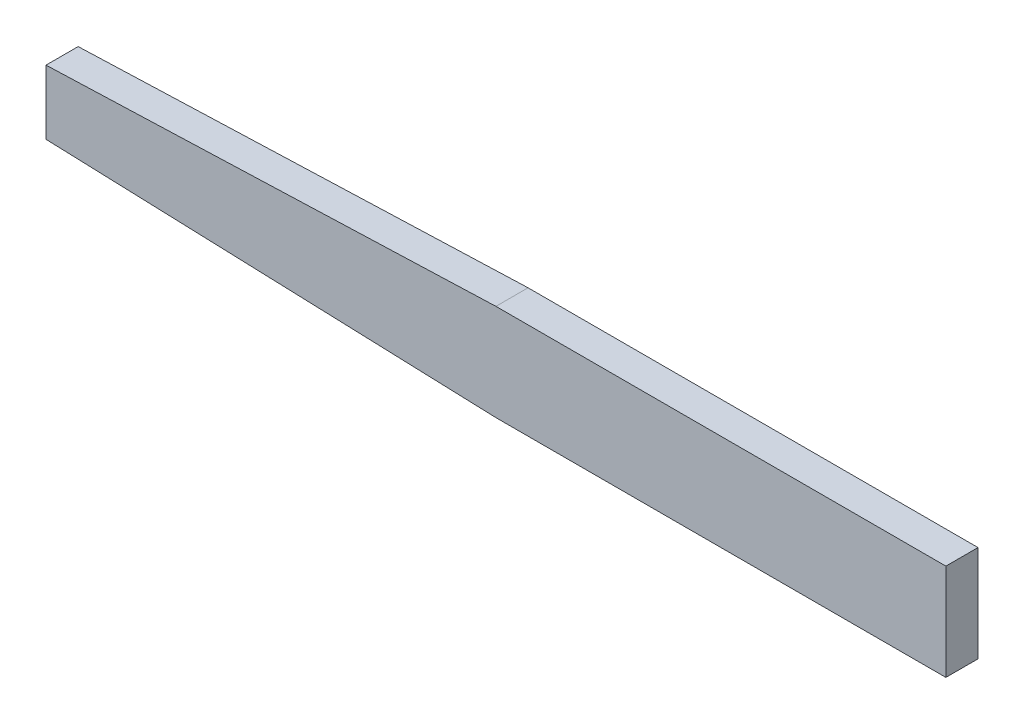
ISO-10303-21;
HEADER;
FILE_DESCRIPTION(('STEP AP214'),'2;1');
FILE_NAME('part.step','',(''),(''),'','','');
FILE_SCHEMA(('AUTOMOTIVE_DESIGN { 1 0 10303 214 1 1 1 1 }'));
ENDSEC;
DATA;
#1=APPLICATION_CONTEXT('core data for automotive mechanical design processes');
#2=APPLICATION_PROTOCOL_DEFINITION('international standard','automotive_design',2000,#1);
#3=PRODUCT_CONTEXT('',#1,'mechanical');
#4=PRODUCT('Part','Part','',(#3));
#5=PRODUCT_RELATED_PRODUCT_CATEGORY('part','',(#4));
#6=PRODUCT_DEFINITION_FORMATION('','',#4);
#7=PRODUCT_DEFINITION_CONTEXT('part definition',#1,'design');
#8=PRODUCT_DEFINITION('design','',#6,#7);
#9=PRODUCT_DEFINITION_SHAPE('','',#8);
#10=(LENGTH_UNIT() NAMED_UNIT(*) SI_UNIT(.MILLI.,.METRE.));
#11=(NAMED_UNIT(*) PLANE_ANGLE_UNIT() SI_UNIT($,.RADIAN.));
#12=(NAMED_UNIT(*) SI_UNIT($,.STERADIAN.) SOLID_ANGLE_UNIT());
#13=UNCERTAINTY_MEASURE_WITH_UNIT(LENGTH_MEASURE(1.E-05),#10,'distance_accuracy_value','');
#14=(GEOMETRIC_REPRESENTATION_CONTEXT(3) GLOBAL_UNCERTAINTY_ASSIGNED_CONTEXT((#13)) GLOBAL_UNIT_ASSIGNED_CONTEXT((#10,
#11,#12)) REPRESENTATION_CONTEXT('',''));
#15=CARTESIAN_POINT('',(0.,0.,0.));
#16=DIRECTION('',(0.,0.,1.));
#17=DIRECTION('',(1.,0.,0.));
#18=AXIS2_PLACEMENT_3D('',#15,#16,#17);
#19=CARTESIAN_POINT('',(-355.6,38.1,-6.35039294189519));
#20=DIRECTION('',(-1.,0.,0.));
#21=DIRECTION('',(0.,0.,1.));
#22=AXIS2_PLACEMENT_3D('',#19,#20,#21);
#23=PLANE('',#22);
#24=DIRECTION('',(0.,-1.,0.));
#25=VECTOR('',#24,1.);
#26=CARTESIAN_POINT('',(-355.6,38.1,0.));
#27=LINE('',#26,#25);
#28=CARTESIAN_POINT('',(-355.6,31.75,0.));
#29=VERTEX_POINT('',#28);
#30=CARTESIAN_POINT('',(-355.6,6.35,0.));
#31=VERTEX_POINT('',#30);
#32=EDGE_CURVE('E104',#29,#31,#27,.T.);
#33=ORIENTED_EDGE('',*,*,#32,.F.);
#34=DIRECTION('',(0.,0.,-1.));
#35=VECTOR('',#34,1.);
#36=CARTESIAN_POINT('',(-355.6,31.75,463.20083901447));
#37=LINE('',#36,#35);
#38=CARTESIAN_POINT('',(-355.6,31.75,-12.7));
#39=VERTEX_POINT('',#38);
#40=EDGE_CURVE('E50',#29,#39,#37,.T.);
#41=ORIENTED_EDGE('',*,*,#40,.T.);
#42=DIRECTION('',(0.,-1.,0.));
#43=VECTOR('',#42,1.);
#44=CARTESIAN_POINT('',(-355.6,38.1,-12.7));
#45=LINE('',#44,#43);
#46=CARTESIAN_POINT('',(-355.6,6.35,-12.7));
#47=VERTEX_POINT('',#46);
#48=EDGE_CURVE('E99',#39,#47,#45,.T.);
#49=ORIENTED_EDGE('',*,*,#48,.T.);
#50=DIRECTION('',(0.,0.,-1.));
#51=VECTOR('',#50,1.);
#52=CARTESIAN_POINT('',(-355.6,6.35,463.20083901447));
#53=LINE('',#52,#51);
#54=EDGE_CURVE('E124',#31,#47,#53,.T.);
#55=ORIENTED_EDGE('',*,*,#54,.F.);
#56=EDGE_LOOP('',(#33,#41,#49,#55));
#57=FACE_BOUND('',#56,.T.);
#58=ADVANCED_FACE('F35',(#57),#23,.T.);
#59=CARTESIAN_POINT('',(-454.733765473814,38.1,-12.7));
#60=DIRECTION('',(0.,0.,-1.));
#61=DIRECTION('',(-1.,0.,0.));
#62=AXIS2_PLACEMENT_3D('',#59,#60,#61);
#63=PLANE('',#62);
#64=DIRECTION('',(-0.99936285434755,-0.0356915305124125,0.));
#65=VECTOR('',#64,1.);
#66=CARTESIAN_POINT('',(-454.380983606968,28.2221077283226,-12.7));
#67=LINE('',#66,#65);
#68=CARTESIAN_POINT('',(-177.8,38.1,-12.7));
#69=VERTEX_POINT('',#68);
#70=EDGE_CURVE('E114',#69,#39,#67,.T.);
#71=ORIENTED_EDGE('',*,*,#70,.F.);
#72=DIRECTION('',(1.,0.,0.));
#73=VECTOR('',#72,1.);
#74=CARTESIAN_POINT('',(-454.733765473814,38.1,-12.7));
#75=LINE('',#74,#73);
#76=CARTESIAN_POINT('',(0.,38.1,-12.7));
#77=VERTEX_POINT('',#76);
#78=EDGE_CURVE('E112',#69,#77,#75,.T.);
#79=ORIENTED_EDGE('',*,*,#78,.T.);
#80=DIRECTION('',(0.,-1.,0.));
#81=VECTOR('',#80,1.);
#82=CARTESIAN_POINT('',(0.,38.1,-12.7));
#83=LINE('',#82,#81);
#84=CARTESIAN_POINT('',(0.,0.,-12.7));
#85=VERTEX_POINT('',#84);
#86=EDGE_CURVE('E118',#77,#85,#83,.T.);
#87=ORIENTED_EDGE('',*,*,#86,.T.);
#88=DIRECTION('',(1.,0.,0.));
#89=VECTOR('',#88,1.);
#90=CARTESIAN_POINT('',(-454.733765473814,0.,-12.7));
#91=LINE('',#90,#89);
#92=CARTESIAN_POINT('',(-177.8,0.,-12.7));
#93=VERTEX_POINT('',#92);
#94=EDGE_CURVE('E110',#93,#85,#91,.T.);
#95=ORIENTED_EDGE('',*,*,#94,.F.);
#96=DIRECTION('',(0.99936285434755,-0.0356915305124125,0.));
#97=VECTOR('',#96,1.);
#98=CARTESIAN_POINT('',(-455.739964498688,9.92642730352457,-12.7));
#99=LINE('',#98,#97);
#100=EDGE_CURVE('E95',#47,#93,#99,.T.);
#101=ORIENTED_EDGE('',*,*,#100,.F.);
#102=ORIENTED_EDGE('',*,*,#48,.F.);
#103=EDGE_LOOP('',(#71,#79,#87,#95,#101,#102));
#104=FACE_BOUND('',#103,.T.);
#105=ADVANCED_FACE('F37',(#104),#63,.T.);
#106=CARTESIAN_POINT('',(-454.733765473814,38.1,0.));
#107=DIRECTION('',(0.,0.,1.));
#108=DIRECTION('',(1.,0.,0.));
#109=AXIS2_PLACEMENT_3D('',#106,#107,#108);
#110=PLANE('',#109);
#111=DIRECTION('',(0.99936285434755,0.0356915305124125,0.));
#112=VECTOR('',#111,1.);
#113=CARTESIAN_POINT('',(-454.380983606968,28.2221077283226,0.));
#114=LINE('',#113,#112);
#115=CARTESIAN_POINT('',(-177.8,38.1,1.14929235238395E-13));
#116=VERTEX_POINT('',#115);
#117=EDGE_CURVE('E58',#29,#116,#114,.T.);
#118=ORIENTED_EDGE('',*,*,#117,.F.);
#119=ORIENTED_EDGE('',*,*,#32,.T.);
#120=DIRECTION('',(-0.99936285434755,0.0356915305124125,0.));
#121=VECTOR('',#120,1.);
#122=CARTESIAN_POINT('',(-455.739964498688,9.92642730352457,0.));
#123=LINE('',#122,#121);
#124=CARTESIAN_POINT('',(-177.8,0.,0.));
#125=VERTEX_POINT('',#124);
#126=EDGE_CURVE('E92',#125,#31,#123,.T.);
#127=ORIENTED_EDGE('',*,*,#126,.F.);
#128=DIRECTION('',(-1.,0.,0.));
#129=VECTOR('',#128,1.);
#130=CARTESIAN_POINT('',(-454.733765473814,0.,0.));
#131=LINE('',#130,#129);
#132=CARTESIAN_POINT('',(0.,0.,0.));
#133=VERTEX_POINT('',#132);
#134=EDGE_CURVE('E103',#133,#125,#131,.T.);
#135=ORIENTED_EDGE('',*,*,#134,.F.);
#136=DIRECTION('',(0.,-1.,0.));
#137=VECTOR('',#136,1.);
#138=CARTESIAN_POINT('',(0.,38.1,0.));
#139=LINE('',#138,#137);
#140=CARTESIAN_POINT('',(0.,38.1,0.));
#141=VERTEX_POINT('',#140);
#142=EDGE_CURVE('E121',#141,#133,#139,.T.);
#143=ORIENTED_EDGE('',*,*,#142,.F.);
#144=DIRECTION('',(-1.,0.,0.));
#145=VECTOR('',#144,1.);
#146=CARTESIAN_POINT('',(-454.733765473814,38.1,0.));
#147=LINE('',#146,#145);
#148=EDGE_CURVE('E135',#141,#116,#147,.T.);
#149=ORIENTED_EDGE('',*,*,#148,.T.);
#150=EDGE_LOOP('',(#118,#119,#127,#135,#143,#149));
#151=FACE_BOUND('',#150,.T.);
#152=ADVANCED_FACE('F102',(#151),#110,.T.);
#153=CARTESIAN_POINT('',(0.,38.1,-6.35039294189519));
#154=DIRECTION('',(-1.,0.,0.));
#155=DIRECTION('',(0.,0.,1.));
#156=AXIS2_PLACEMENT_3D('',#153,#154,#155);
#157=PLANE('',#156);
#158=DIRECTION('',(0.,0.,-1.));
#159=VECTOR('',#158,1.);
#160=CARTESIAN_POINT('',(0.,0.,-6.35039294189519));
#161=LINE('',#160,#159);
#162=EDGE_CURVE('E109',#133,#85,#161,.T.);
#163=ORIENTED_EDGE('',*,*,#162,.T.);
#164=ORIENTED_EDGE('',*,*,#86,.F.);
#165=DIRECTION('',(0.,0.,-1.));
#166=VECTOR('',#165,1.);
#167=CARTESIAN_POINT('',(0.,38.1,-6.35039294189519));
#168=LINE('',#167,#166);
#169=EDGE_CURVE('E122',#141,#77,#168,.T.);
#170=ORIENTED_EDGE('',*,*,#169,.F.);
#171=ORIENTED_EDGE('',*,*,#142,.T.);
#172=EDGE_LOOP('',(#163,#164,#170,#171));
#173=FACE_BOUND('',#172,.T.);
#174=ADVANCED_FACE('F143',(#173),#157,.F.);
#175=CARTESIAN_POINT('',(-454.733765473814,38.1,-6.35039294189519));
#176=DIRECTION('',(0.,1.,0.));
#177=DIRECTION('',(0.,0.,1.));
#178=AXIS2_PLACEMENT_3D('',#175,#176,#177);
#179=PLANE('',#178);
#180=DIRECTION('',(0.,0.,-1.));
#181=VECTOR('',#180,1.);
#182=CARTESIAN_POINT('',(-177.8,38.1,-6.35039294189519));
#183=LINE('',#182,#181);
#184=EDGE_CURVE('E11',#116,#69,#183,.T.);
#185=ORIENTED_EDGE('',*,*,#184,.F.);
#186=ORIENTED_EDGE('',*,*,#148,.F.);
#187=ORIENTED_EDGE('',*,*,#169,.T.);
#188=ORIENTED_EDGE('',*,*,#78,.F.);
#189=EDGE_LOOP('',(#185,#186,#187,#188));
#190=FACE_BOUND('',#189,.T.);
#191=ADVANCED_FACE('F141',(#190),#179,.T.);
#192=CARTESIAN_POINT('',(-454.733765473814,0.,-6.35039294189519));
#193=DIRECTION('',(0.,1.,0.));
#194=DIRECTION('',(0.,0.,1.));
#195=AXIS2_PLACEMENT_3D('',#192,#193,#194);
#196=PLANE('',#195);
#197=ORIENTED_EDGE('',*,*,#134,.T.);
#198=DIRECTION('',(0.,0.,-1.));
#199=VECTOR('',#198,1.);
#200=CARTESIAN_POINT('',(-177.8,0.,463.20083901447));
#201=LINE('',#200,#199);
#202=EDGE_CURVE('E43',#125,#93,#201,.T.);
#203=ORIENTED_EDGE('',*,*,#202,.T.);
#204=ORIENTED_EDGE('',*,*,#94,.T.);
#205=ORIENTED_EDGE('',*,*,#162,.F.);
#206=EDGE_LOOP('',(#197,#203,#204,#205));
#207=FACE_BOUND('',#206,.T.);
#208=ADVANCED_FACE('F107',(#207),#196,.F.);
#209=CARTESIAN_POINT('',(-177.8,0.,463.20083901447));
#210=DIRECTION('',(0.0356915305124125,0.999362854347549,0.));
#211=DIRECTION('',(-0.99936285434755,0.0356915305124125,0.));
#212=AXIS2_PLACEMENT_3D('',#209,#210,#211);
#213=PLANE('',#212);
#214=ORIENTED_EDGE('',*,*,#54,.T.);
#215=ORIENTED_EDGE('',*,*,#100,.T.);
#216=ORIENTED_EDGE('',*,*,#202,.F.);
#217=ORIENTED_EDGE('',*,*,#126,.T.);
#218=EDGE_LOOP('',(#214,#215,#216,#217));
#219=FACE_BOUND('',#218,.T.);
#220=ADVANCED_FACE('F91',(#219),#213,.F.);
#221=CARTESIAN_POINT('',(-177.8,38.1,463.20083901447));
#222=DIRECTION('',(0.0356915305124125,-0.999362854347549,0.));
#223=DIRECTION('',(0.99936285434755,0.0356915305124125,0.));
#224=AXIS2_PLACEMENT_3D('',#221,#222,#223);
#225=PLANE('',#224);
#226=ORIENTED_EDGE('',*,*,#184,.T.);
#227=ORIENTED_EDGE('',*,*,#70,.T.);
#228=ORIENTED_EDGE('',*,*,#40,.F.);
#229=ORIENTED_EDGE('',*,*,#117,.T.);
#230=EDGE_LOOP('',(#226,#227,#228,#229));
#231=FACE_BOUND('',#230,.T.);
#232=ADVANCED_FACE('F129',(#231),#225,.F.);
#233=CLOSED_SHELL('',(#58,#105,#152,#174,#191,#208,#220,#232));
#234=MANIFOLD_SOLID_BREP('B2',#233);
#235=ADVANCED_BREP_SHAPE_REPRESENTATION('',(#18,#234),#14);
#236=SHAPE_DEFINITION_REPRESENTATION(#9,#235);
ENDSEC;
END-ISO-10303-21;
